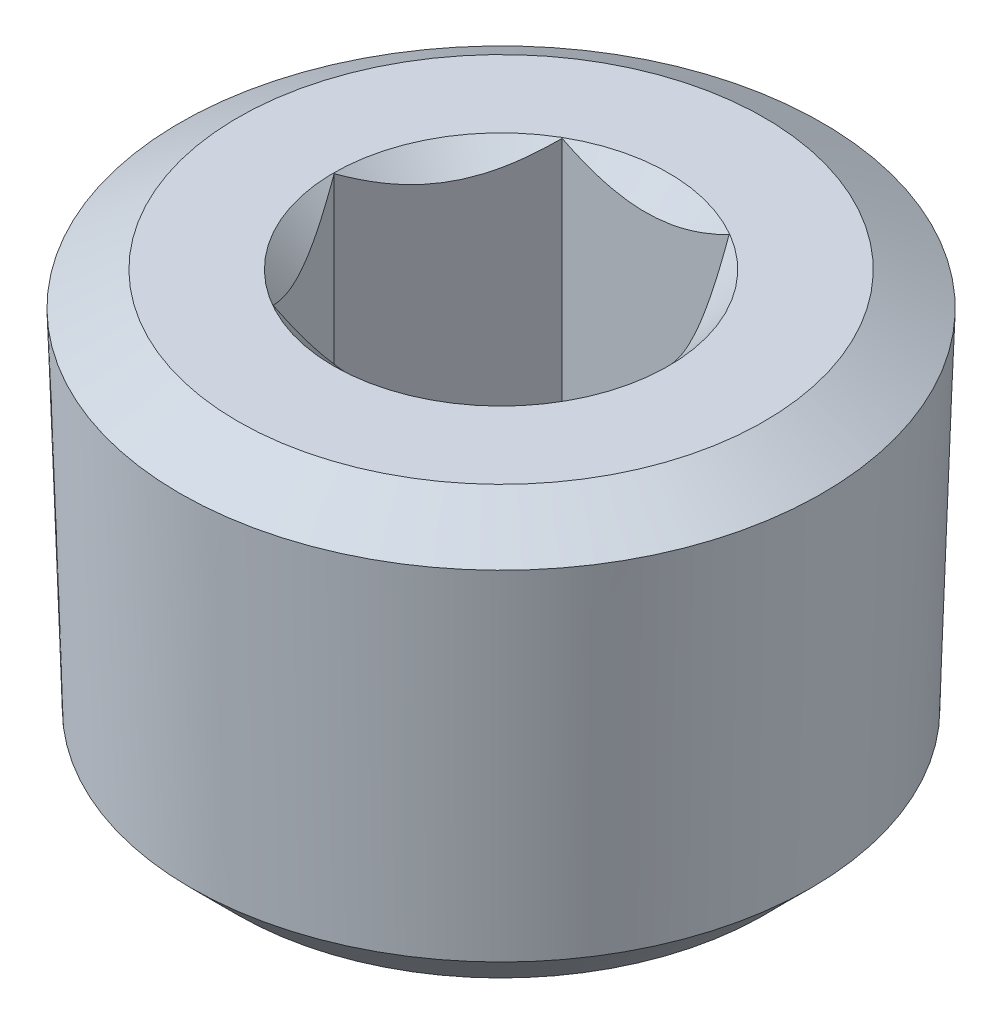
from build123d import *

# Parameters (mm, degrees)
CUT_EXTRUDE1_START = -8.89
CUT_EXTRUDE1_DEPTH = 8.874585


with BuildPart() as part:
    # Sketch2 → Revolve1 (revolve)
    with BuildSketch(Plane.XY, mode=Mode.PRIVATE) as revolve1_sk:
        Polygon((0, 0), (-8.787288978, 0), (-10.722030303, -1.117023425), (-10.360396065, -12.701692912), (-8.787288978, -14.2748), (0, -14.2748), align=None)
    revolve(revolve1_sk.sketch.rotate(Axis((0, 10.744282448, 0), (0, -1, 0)), 270), axis=Axis((0, 10.744282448, 0), (0, -1, 0)))

    # Sketch3 → Cut-Revolve1 (revolve, cut)
    with BuildSketch(Plane.XY, mode=Mode.PRIVATE) as cut_revolve1_sk:
        Polygon((0, 0), (-5.588, 0), (-4.826, -0.762), (-4.826, -8.89), (-2.712365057, -10.16), (0, -10.16), align=None)
    revolve(cut_revolve1_sk.sketch.rotate(Axis((0, 2.934222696, 0), (0, -1, 0)), 270), axis=Axis((0, 2.934222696, 0), (0, -1, 0)), mode=Mode.SUBTRACT)

    # Sketch4 → Cut-Extrude1 (cut)
    with BuildSketch(Plane(origin=(0, 0, 0), x_dir=(1, 0, 0), z_dir=(0, 1, 0)).offset(CUT_EXTRUDE1_START)):
        Polygon((-2.786292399, -4.826), (2.786292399, -4.826), (5.572584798, 0), (2.786292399, 4.826), (-2.786292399, 4.826), (-5.572584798, 0), align=None)
    extrude(amount=CUT_EXTRUDE1_DEPTH, mode=Mode.SUBTRACT)


solid = part.part
